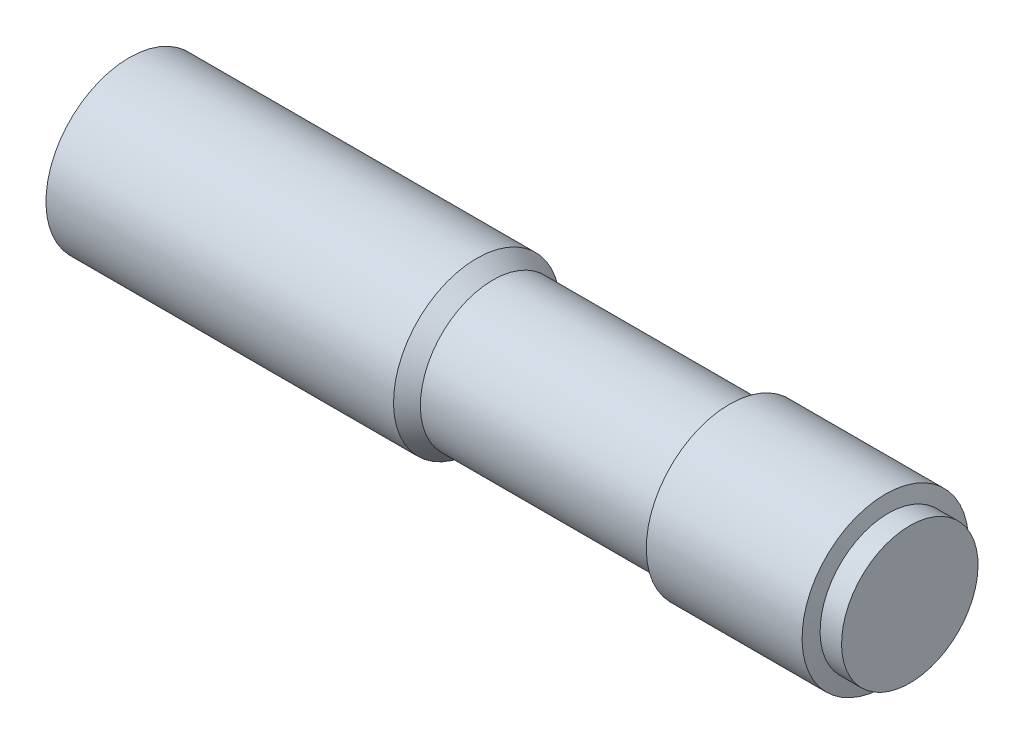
ISO-10303-21;
HEADER;
FILE_DESCRIPTION(('STEP AP214'),'2;1');
FILE_NAME('part.step','',(''),(''),'','','');
FILE_SCHEMA(('AUTOMOTIVE_DESIGN { 1 0 10303 214 1 1 1 1 }'));
ENDSEC;
DATA;
#1=APPLICATION_CONTEXT('core data for automotive mechanical design processes');
#2=APPLICATION_PROTOCOL_DEFINITION('international standard','automotive_design',2000,#1);
#3=PRODUCT_CONTEXT('',#1,'mechanical');
#4=PRODUCT('Part','Part','',(#3));
#5=PRODUCT_RELATED_PRODUCT_CATEGORY('part','',(#4));
#6=PRODUCT_DEFINITION_FORMATION('','',#4);
#7=PRODUCT_DEFINITION_CONTEXT('part definition',#1,'design');
#8=PRODUCT_DEFINITION('design','',#6,#7);
#9=PRODUCT_DEFINITION_SHAPE('','',#8);
#10=(LENGTH_UNIT() NAMED_UNIT(*) SI_UNIT(.MILLI.,.METRE.));
#11=(NAMED_UNIT(*) PLANE_ANGLE_UNIT() SI_UNIT($,.RADIAN.));
#12=(NAMED_UNIT(*) SI_UNIT($,.STERADIAN.) SOLID_ANGLE_UNIT());
#13=UNCERTAINTY_MEASURE_WITH_UNIT(LENGTH_MEASURE(1.E-05),#10,'distance_accuracy_value','');
#14=(GEOMETRIC_REPRESENTATION_CONTEXT(3) GLOBAL_UNCERTAINTY_ASSIGNED_CONTEXT((#13)) GLOBAL_UNIT_ASSIGNED_CONTEXT((#10,
#11,#12)) REPRESENTATION_CONTEXT('',''));
#15=CARTESIAN_POINT('',(0.,0.,0.));
#16=DIRECTION('',(0.,0.,1.));
#17=DIRECTION('',(1.,0.,0.));
#18=AXIS2_PLACEMENT_3D('',#15,#16,#17);
#19=CARTESIAN_POINT('',(-72.9656387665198,5.22543607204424,0.));
#20=DIRECTION('',(-1.,0.,0.));
#21=DIRECTION('',(0.,-1.,0.));
#22=AXIS2_PLACEMENT_3D('',#19,#20,#21);
#23=PLANE('',#22);
#24=CARTESIAN_POINT('',(-72.9656387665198,5.22543607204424,0.));
#25=DIRECTION('',(1.,0.,0.));
#26=DIRECTION('',(0.,1.,0.));
#27=AXIS2_PLACEMENT_3D('',#24,#25,#26);
#28=CIRCLE('',#27,15.5);
#29=CARTESIAN_POINT('',(-72.9656387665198,20.7254360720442,0.));
#30=VERTEX_POINT('',#29);
#31=EDGE_CURVE('E10',#30,#30,#28,.T.);
#32=ORIENTED_EDGE('',*,*,#31,.F.);
#33=EDGE_LOOP('',(#32));
#34=FACE_BOUND('',#33,.T.);
#35=ADVANCED_FACE('F28',(#34),#23,.T.);
#36=CARTESIAN_POINT('',(72.3349405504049,5.22543607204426,0.));
#37=DIRECTION('',(1.,0.,0.));
#38=DIRECTION('',(0.,1.,0.));
#39=AXIS2_PLACEMENT_3D('',#36,#37,#38);
#40=CYLINDRICAL_SURFACE('',#39,15.5);
#41=ORIENTED_EDGE('',*,*,#31,.T.);
#42=EDGE_LOOP('',(#41));
#43=FACE_BOUND('',#42,.T.);
#44=CARTESIAN_POINT('',(-8.2656387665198,5.22543607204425,0.));
#45=DIRECTION('',(1.,0.,0.));
#46=DIRECTION('',(0.,1.,0.));
#47=AXIS2_PLACEMENT_3D('',#44,#45,#46);
#48=CIRCLE('',#47,15.5);
#49=CARTESIAN_POINT('',(-8.2656387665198,20.7254360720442,0.));
#50=VERTEX_POINT('',#49);
#51=EDGE_CURVE('E34',#50,#50,#48,.T.);
#52=ORIENTED_EDGE('',*,*,#51,.F.);
#53=EDGE_LOOP('',(#52));
#54=FACE_BOUND('',#53,.T.);
#55=ADVANCED_FACE('F76',(#43,#54),#40,.T.);
#56=CARTESIAN_POINT('',(-5.27290748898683,5.22543607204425,0.));
#57=DIRECTION('',(-1.,0.,0.));
#58=DIRECTION('',(0.,-1.,0.));
#59=AXIS2_PLACEMENT_3D('',#56,#57,#58);
#60=CONICAL_SURFACE('',#59,13.5,0.589122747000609);
#61=ORIENTED_EDGE('',*,*,#51,.T.);
#62=EDGE_LOOP('',(#61));
#63=FACE_BOUND('',#62,.T.);
#64=CARTESIAN_POINT('',(-5.27290748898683,5.22543607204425,0.));
#65=DIRECTION('',(1.,0.,0.));
#66=DIRECTION('',(0.,1.,0.));
#67=AXIS2_PLACEMENT_3D('',#64,#65,#66);
#68=CIRCLE('',#67,13.5);
#69=CARTESIAN_POINT('',(-5.27290748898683,18.7254360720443,0.));
#70=VERTEX_POINT('',#69);
#71=EDGE_CURVE('E38',#70,#70,#68,.T.);
#72=ORIENTED_EDGE('',*,*,#71,.F.);
#73=EDGE_LOOP('',(#72));
#74=FACE_BOUND('',#73,.T.);
#75=ADVANCED_FACE('F81',(#63,#74),#60,.T.);
#76=CARTESIAN_POINT('',(72.3349405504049,5.22543607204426,0.));
#77=DIRECTION('',(1.,0.,0.));
#78=DIRECTION('',(0.,1.,0.));
#79=AXIS2_PLACEMENT_3D('',#76,#77,#78);
#80=CYLINDRICAL_SURFACE('',#79,13.5);
#81=ORIENTED_EDGE('',*,*,#71,.T.);
#82=EDGE_LOOP('',(#81));
#83=FACE_BOUND('',#82,.T.);
#84=CARTESIAN_POINT('',(37.4416299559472,5.22543607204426,0.));
#85=DIRECTION('',(1.,0.,0.));
#86=DIRECTION('',(0.,1.,0.));
#87=AXIS2_PLACEMENT_3D('',#84,#85,#86);
#88=CIRCLE('',#87,13.5);
#89=CARTESIAN_POINT('',(37.4416299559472,18.7254360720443,0.));
#90=VERTEX_POINT('',#89);
#91=EDGE_CURVE('E42',#90,#90,#88,.T.);
#92=ORIENTED_EDGE('',*,*,#91,.F.);
#93=EDGE_LOOP('',(#92));
#94=FACE_BOUND('',#93,.T.);
#95=ADVANCED_FACE('F85',(#83,#94),#80,.T.);
#96=CARTESIAN_POINT('',(38.7782016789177,5.22543607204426,0.));
#97=DIRECTION('',(1.,0.,0.));
#98=DIRECTION('',(0.,1.,0.));
#99=AXIS2_PLACEMENT_3D('',#96,#97,#98);
#100=CONICAL_SURFACE('',#99,15.5,0.981673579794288);
#101=ORIENTED_EDGE('',*,*,#91,.T.);
#102=EDGE_LOOP('',(#101));
#103=FACE_BOUND('',#102,.T.);
#104=CARTESIAN_POINT('',(38.7782016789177,5.22543607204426,0.));
#105=DIRECTION('',(1.,0.,0.));
#106=DIRECTION('',(0.,1.,0.));
#107=AXIS2_PLACEMENT_3D('',#104,#105,#106);
#108=CIRCLE('',#107,15.5);
#109=CARTESIAN_POINT('',(38.7782016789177,20.7254360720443,0.));
#110=VERTEX_POINT('',#109);
#111=EDGE_CURVE('E47',#110,#110,#108,.T.);
#112=ORIENTED_EDGE('',*,*,#111,.F.);
#113=EDGE_LOOP('',(#112));
#114=FACE_BOUND('',#113,.T.);
#115=ADVANCED_FACE('F91',(#103,#114),#100,.T.);
#116=CARTESIAN_POINT('',(72.3349405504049,5.22543607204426,0.));
#117=DIRECTION('',(1.,0.,0.));
#118=DIRECTION('',(0.,1.,0.));
#119=AXIS2_PLACEMENT_3D('',#116,#117,#118);
#120=CYLINDRICAL_SURFACE('',#119,15.5);
#121=ORIENTED_EDGE('',*,*,#111,.T.);
#122=EDGE_LOOP('',(#121));
#123=FACE_BOUND('',#122,.T.);
#124=CARTESIAN_POINT('',(67.7782016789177,5.22543607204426,0.));
#125=DIRECTION('',(1.,0.,0.));
#126=DIRECTION('',(0.,1.,0.));
#127=AXIS2_PLACEMENT_3D('',#124,#125,#126);
#128=CIRCLE('',#127,15.5);
#129=CARTESIAN_POINT('',(67.7782016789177,20.7254360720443,0.));
#130=VERTEX_POINT('',#129);
#131=EDGE_CURVE('E50',#130,#130,#128,.T.);
#132=ORIENTED_EDGE('',*,*,#131,.F.);
#133=EDGE_LOOP('',(#132));
#134=FACE_BOUND('',#133,.T.);
#135=ADVANCED_FACE('F72',(#123,#134),#120,.T.);
#136=CARTESIAN_POINT('',(68.3349405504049,5.22543607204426,0.));
#137=DIRECTION('',(-1.,0.,0.));
#138=DIRECTION('',(0.,-1.,0.));
#139=AXIS2_PLACEMENT_3D('',#136,#137,#138);
#140=CONICAL_SURFACE('',#139,12.7,1.37452091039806);
#141=ORIENTED_EDGE('',*,*,#131,.T.);
#142=EDGE_LOOP('',(#141));
#143=FACE_BOUND('',#142,.T.);
#144=CARTESIAN_POINT('',(68.3349405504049,5.22543607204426,0.));
#145=DIRECTION('',(1.,0.,0.));
#146=DIRECTION('',(0.,1.,0.));
#147=AXIS2_PLACEMENT_3D('',#144,#145,#146);
#148=CIRCLE('',#147,12.7);
#149=CARTESIAN_POINT('',(68.3349405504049,17.9254360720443,0.));
#150=VERTEX_POINT('',#149);
#151=EDGE_CURVE('E53',#150,#150,#148,.T.);
#152=ORIENTED_EDGE('',*,*,#151,.F.);
#153=EDGE_LOOP('',(#152));
#154=FACE_BOUND('',#153,.T.);
#155=ADVANCED_FACE('F64',(#143,#154),#140,.T.);
#156=CARTESIAN_POINT('',(72.3349405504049,5.22543607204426,0.));
#157=DIRECTION('',(1.,0.,0.));
#158=DIRECTION('',(0.,1.,0.));
#159=AXIS2_PLACEMENT_3D('',#156,#157,#158);
#160=CYLINDRICAL_SURFACE('',#159,12.7);
#161=ORIENTED_EDGE('',*,*,#151,.T.);
#162=EDGE_LOOP('',(#161));
#163=FACE_BOUND('',#162,.T.);
#164=CARTESIAN_POINT('',(72.3349405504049,5.22543607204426,0.));
#165=DIRECTION('',(1.,0.,0.));
#166=DIRECTION('',(0.,1.,0.));
#167=AXIS2_PLACEMENT_3D('',#164,#165,#166);
#168=CIRCLE('',#167,12.7);
#169=CARTESIAN_POINT('',(72.3349405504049,17.9254360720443,0.));
#170=VERTEX_POINT('',#169);
#171=EDGE_CURVE('E56',#170,#170,#168,.T.);
#172=ORIENTED_EDGE('',*,*,#171,.F.);
#173=EDGE_LOOP('',(#172));
#174=FACE_BOUND('',#173,.T.);
#175=ADVANCED_FACE('F62',(#163,#174),#160,.T.);
#176=CARTESIAN_POINT('',(72.3349405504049,17.9254360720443,0.));
#177=DIRECTION('',(1.,0.,0.));
#178=DIRECTION('',(0.,1.,0.));
#179=AXIS2_PLACEMENT_3D('',#176,#177,#178);
#180=PLANE('',#179);
#181=ORIENTED_EDGE('',*,*,#171,.T.);
#182=EDGE_LOOP('',(#181));
#183=FACE_BOUND('',#182,.T.);
#184=ADVANCED_FACE('F60',(#183),#180,.T.);
#185=CLOSED_SHELL('',(#35,#55,#75,#95,#115,#135,#155,#175,#184));
#186=MANIFOLD_SOLID_BREP('B2',#185);
#187=ADVANCED_BREP_SHAPE_REPRESENTATION('',(#18,#186),#14);
#188=SHAPE_DEFINITION_REPRESENTATION(#9,#187);
ENDSEC;
END-ISO-10303-21;
